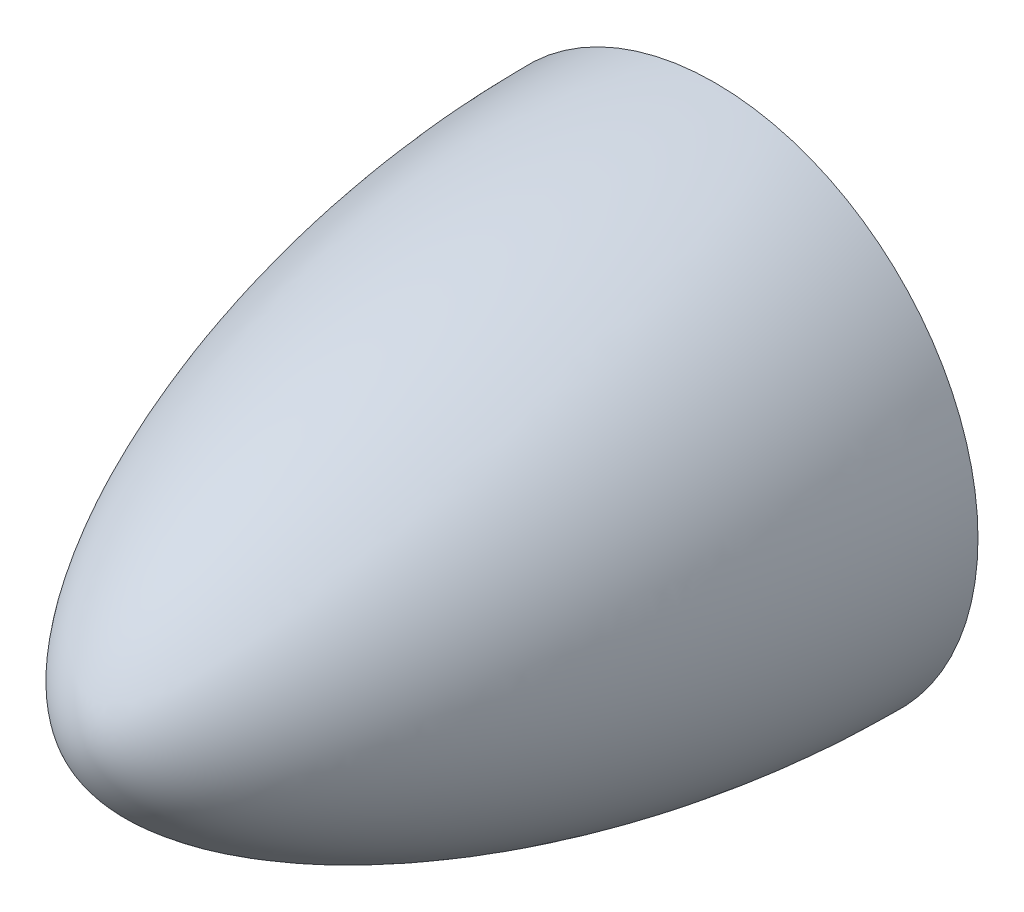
ISO-10303-21;
HEADER;
FILE_DESCRIPTION(('STEP AP214'),'2;1');
FILE_NAME('part.step','',(''),(''),'','','');
FILE_SCHEMA(('AUTOMOTIVE_DESIGN { 1 0 10303 214 1 1 1 1 }'));
ENDSEC;
DATA;
#1=APPLICATION_CONTEXT('core data for automotive mechanical design processes');
#2=APPLICATION_PROTOCOL_DEFINITION('international standard','automotive_design',2000,#1);
#3=PRODUCT_CONTEXT('',#1,'mechanical');
#4=PRODUCT('Part','Part','',(#3));
#5=PRODUCT_RELATED_PRODUCT_CATEGORY('part','',(#4));
#6=PRODUCT_DEFINITION_FORMATION('','',#4);
#7=PRODUCT_DEFINITION_CONTEXT('part definition',#1,'design');
#8=PRODUCT_DEFINITION('design','',#6,#7);
#9=PRODUCT_DEFINITION_SHAPE('','',#8);
#10=(LENGTH_UNIT() NAMED_UNIT(*) SI_UNIT(.MILLI.,.METRE.));
#11=(NAMED_UNIT(*) PLANE_ANGLE_UNIT() SI_UNIT($,.RADIAN.));
#12=(NAMED_UNIT(*) SI_UNIT($,.STERADIAN.) SOLID_ANGLE_UNIT());
#13=UNCERTAINTY_MEASURE_WITH_UNIT(LENGTH_MEASURE(1.E-05),#10,'distance_accuracy_value','');
#14=(GEOMETRIC_REPRESENTATION_CONTEXT(3) GLOBAL_UNCERTAINTY_ASSIGNED_CONTEXT((#13)) GLOBAL_UNIT_ASSIGNED_CONTEXT((#10,
#11,#12)) REPRESENTATION_CONTEXT('',''));
#15=CARTESIAN_POINT('',(0.,0.,0.));
#16=DIRECTION('',(0.,0.,1.));
#17=DIRECTION('',(1.,0.,0.));
#18=AXIS2_PLACEMENT_3D('',#15,#16,#17);
#19=CARTESIAN_POINT('',(0.,5.,0.));
#20=CARTESIAN_POINT('',(0.,5.00825012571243,6.1796021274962));
#21=CARTESIAN_POINT('',(0.,2.2041463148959,11.9949373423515));
#22=CARTESIAN_POINT('',(0.,0.,12.));
#23=B_SPLINE_CURVE_WITH_KNOTS('',3,(#19,#20,#21,#22),.UNSPECIFIED.,.F.,.F.,(4,4),(0.,
0.815099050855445),.UNSPECIFIED.);
#24=CARTESIAN_POINT('',(0.,0.,14.3168316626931));
#25=DIRECTION('',(0.,0.,1.));
#26=AXIS1_PLACEMENT('',#24,#25);
#27=SURFACE_OF_REVOLUTION('',#23,#26);
#28=CARTESIAN_POINT('',(0.,0.,12.));
#29=VERTEX_POINT('',#28);
#30=VERTEX_LOOP('',#29);
#31=FACE_BOUND('',#30,.T.);
#32=CARTESIAN_POINT('',(0.,0.,0.));
#33=DIRECTION('',(0.,0.,1.));
#34=DIRECTION('',(1.,0.,0.));
#35=AXIS2_PLACEMENT_3D('',#32,#33,#34);
#36=CIRCLE('',#35,5.);
#37=CARTESIAN_POINT('',(5.,0.,0.));
#38=VERTEX_POINT('',#37);
#39=EDGE_CURVE('E11',#38,#38,#36,.T.);
#40=ORIENTED_EDGE('',*,*,#39,.T.);
#41=EDGE_LOOP('',(#40));
#42=FACE_BOUND('',#41,.T.);
#43=ADVANCED_FACE('F32',(#31,#42),#27,.T.);
#44=CARTESIAN_POINT('',(0.,5.,0.));
#45=DIRECTION('',(0.,0.,1.));
#46=DIRECTION('',(1.,0.,0.));
#47=AXIS2_PLACEMENT_3D('',#44,#45,#46);
#48=PLANE('',#47);
#49=CARTESIAN_POINT('',(0.,0.,0.));
#50=DIRECTION('',(0.,0.,-1.));
#51=DIRECTION('',(-1.,0.,0.));
#52=AXIS2_PLACEMENT_3D('',#49,#50,#51);
#53=CIRCLE('',#52,1.);
#54=CARTESIAN_POINT('',(-1.,0.,0.));
#55=VERTEX_POINT('',#54);
#56=EDGE_CURVE('E63',#55,#55,#53,.T.);
#57=ORIENTED_EDGE('',*,*,#56,.F.);
#58=EDGE_LOOP('',(#57));
#59=FACE_BOUND('',#58,.T.);
#60=ORIENTED_EDGE('',*,*,#39,.F.);
#61=EDGE_LOOP('',(#60));
#62=FACE_BOUND('',#61,.T.);
#63=ADVANCED_FACE('F43',(#59,#62),#48,.F.);
#64=CARTESIAN_POINT('',(0.,0.,3.));
#65=DIRECTION('',(0.,0.,-1.));
#66=DIRECTION('',(-1.,0.,0.));
#67=AXIS2_PLACEMENT_3D('',#64,#65,#66);
#68=CYLINDRICAL_SURFACE('',#67,1.);
#69=CARTESIAN_POINT('',(0.,0.,3.));
#70=DIRECTION('',(0.,0.,-1.));
#71=DIRECTION('',(-1.,0.,0.));
#72=AXIS2_PLACEMENT_3D('',#69,#70,#71);
#73=CIRCLE('',#72,1.);
#74=CARTESIAN_POINT('',(-1.,0.,3.));
#75=VERTEX_POINT('',#74);
#76=EDGE_CURVE('E38',#75,#75,#73,.T.);
#77=ORIENTED_EDGE('',*,*,#76,.F.);
#78=EDGE_LOOP('',(#77));
#79=FACE_BOUND('',#78,.T.);
#80=ORIENTED_EDGE('',*,*,#56,.T.);
#81=EDGE_LOOP('',(#80));
#82=FACE_BOUND('',#81,.T.);
#83=ADVANCED_FACE('F47',(#79,#82),#68,.F.);
#84=CARTESIAN_POINT('',(0.,0.,3.));
#85=DIRECTION('',(0.,0.,-1.));
#86=DIRECTION('',(-1.,0.,0.));
#87=AXIS2_PLACEMENT_3D('',#84,#85,#86);
#88=PLANE('',#87);
#89=ORIENTED_EDGE('',*,*,#76,.T.);
#90=EDGE_LOOP('',(#89));
#91=FACE_BOUND('',#90,.T.);
#92=ADVANCED_FACE('F52',(#91),#88,.T.);
#93=CLOSED_SHELL('',(#43,#63,#83,#92));
#94=MANIFOLD_SOLID_BREP('B2',#93);
#95=ADVANCED_BREP_SHAPE_REPRESENTATION('',(#18,#94),#14);
#96=SHAPE_DEFINITION_REPRESENTATION(#9,#95);
ENDSEC;
END-ISO-10303-21;
